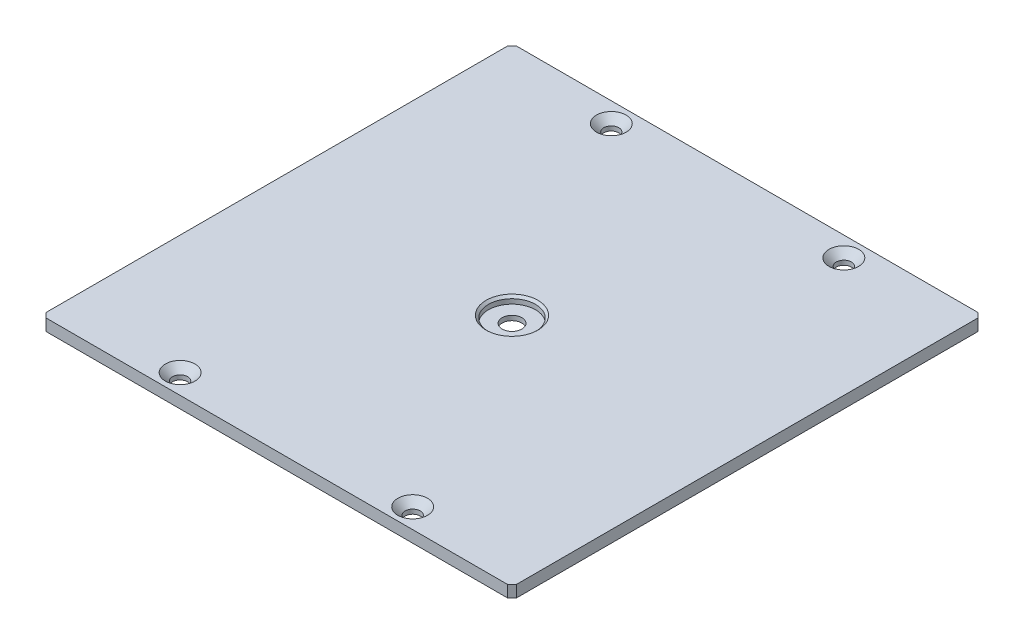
ISO-10303-21;
HEADER;
FILE_DESCRIPTION(('STEP AP214'),'2;1');
FILE_NAME('part.step','',(''),(''),'','','');
FILE_SCHEMA(('AUTOMOTIVE_DESIGN { 1 0 10303 214 1 1 1 1 }'));
ENDSEC;
DATA;
#1=APPLICATION_CONTEXT('core data for automotive mechanical design processes');
#2=APPLICATION_PROTOCOL_DEFINITION('international standard','automotive_design',2000,#1);
#3=PRODUCT_CONTEXT('',#1,'mechanical');
#4=PRODUCT('Part','Part','',(#3));
#5=PRODUCT_RELATED_PRODUCT_CATEGORY('part','',(#4));
#6=PRODUCT_DEFINITION_FORMATION('','',#4);
#7=PRODUCT_DEFINITION_CONTEXT('part definition',#1,'design');
#8=PRODUCT_DEFINITION('design','',#6,#7);
#9=PRODUCT_DEFINITION_SHAPE('','',#8);
#10=(LENGTH_UNIT() NAMED_UNIT(*) SI_UNIT(.MILLI.,.METRE.));
#11=(NAMED_UNIT(*) PLANE_ANGLE_UNIT() SI_UNIT($,.RADIAN.));
#12=(NAMED_UNIT(*) SI_UNIT($,.STERADIAN.) SOLID_ANGLE_UNIT());
#13=UNCERTAINTY_MEASURE_WITH_UNIT(LENGTH_MEASURE(1.E-05),#10,'distance_accuracy_value','');
#14=(GEOMETRIC_REPRESENTATION_CONTEXT(3) GLOBAL_UNCERTAINTY_ASSIGNED_CONTEXT((#13)) GLOBAL_UNIT_ASSIGNED_CONTEXT((#10,
#11,#12)) REPRESENTATION_CONTEXT('',''));
#15=CARTESIAN_POINT('',(0.,0.,0.));
#16=DIRECTION('',(0.,0.,1.));
#17=DIRECTION('',(1.,0.,0.));
#18=AXIS2_PLACEMENT_3D('',#15,#16,#17);
#19=CARTESIAN_POINT('',(0.,0.,0.));
#20=DIRECTION('',(0.,-1.,0.));
#21=DIRECTION('',(0.,0.,-1.));
#22=AXIS2_PLACEMENT_3D('',#19,#20,#21);
#23=PLANE('',#22);
#24=CARTESIAN_POINT('',(-24.7,0.,-45.8));
#25=DIRECTION('',(0.,-1.,0.));
#26=DIRECTION('',(0.,0.,-1.));
#27=AXIS2_PLACEMENT_3D('',#24,#25,#26);
#28=CIRCLE('',#27,1.6);
#29=CARTESIAN_POINT('',(-24.7,0.,-47.4));
#30=VERTEX_POINT('',#29);
#31=EDGE_CURVE('E384',#30,#30,#28,.T.);
#32=ORIENTED_EDGE('',*,*,#31,.F.);
#33=EDGE_LOOP('',(#32));
#34=FACE_BOUND('',#33,.T.);
#35=CARTESIAN_POINT('',(24.7,0.,-45.8));
#36=DIRECTION('',(0.,-1.,0.));
#37=DIRECTION('',(0.,0.,-1.));
#38=AXIS2_PLACEMENT_3D('',#35,#36,#37);
#39=CIRCLE('',#38,1.6);
#40=CARTESIAN_POINT('',(24.7,0.,-47.4));
#41=VERTEX_POINT('',#40);
#42=EDGE_CURVE('E379',#41,#41,#39,.T.);
#43=ORIENTED_EDGE('',*,*,#42,.F.);
#44=EDGE_LOOP('',(#43));
#45=FACE_BOUND('',#44,.T.);
#46=CARTESIAN_POINT('',(-24.7,0.,45.8));
#47=DIRECTION('',(0.,-1.,0.));
#48=DIRECTION('',(0.,0.,-1.));
#49=AXIS2_PLACEMENT_3D('',#46,#47,#48);
#50=CIRCLE('',#49,1.6);
#51=CARTESIAN_POINT('',(-24.7,0.,44.2));
#52=VERTEX_POINT('',#51);
#53=EDGE_CURVE('E374',#52,#52,#50,.T.);
#54=ORIENTED_EDGE('',*,*,#53,.F.);
#55=EDGE_LOOP('',(#54));
#56=FACE_BOUND('',#55,.T.);
#57=CARTESIAN_POINT('',(24.7,0.,45.8));
#58=DIRECTION('',(0.,-1.,0.));
#59=DIRECTION('',(0.,0.,-1.));
#60=AXIS2_PLACEMENT_3D('',#57,#58,#59);
#61=CIRCLE('',#60,1.6);
#62=CARTESIAN_POINT('',(24.7,0.,44.2));
#63=VERTEX_POINT('',#62);
#64=EDGE_CURVE('E370',#63,#63,#61,.T.);
#65=ORIENTED_EDGE('',*,*,#64,.F.);
#66=EDGE_LOOP('',(#65));
#67=FACE_BOUND('',#66,.T.);
#68=DIRECTION('',(-1.,0.,0.));
#69=VECTOR('',#68,1.);
#70=CARTESIAN_POINT('',(47.4,0.,17.));
#71=LINE('',#70,#69);
#72=CARTESIAN_POINT('',(47.4,0.,17.));
#73=VERTEX_POINT('',#72);
#74=CARTESIAN_POINT('',(45.4,0.,17.));
#75=VERTEX_POINT('',#74);
#76=EDGE_CURVE('E223',#73,#75,#71,.T.);
#77=ORIENTED_EDGE('',*,*,#76,.F.);
#78=DIRECTION('',(0.,0.,1.));
#79=VECTOR('',#78,1.);
#80=CARTESIAN_POINT('',(47.4,0.,-17.));
#81=LINE('',#80,#79);
#82=CARTESIAN_POINT('',(47.4,0.,-17.));
#83=VERTEX_POINT('',#82);
#84=EDGE_CURVE('E220',#83,#73,#81,.T.);
#85=ORIENTED_EDGE('',*,*,#84,.F.);
#86=DIRECTION('',(1.,0.,0.));
#87=VECTOR('',#86,1.);
#88=CARTESIAN_POINT('',(47.4,0.,-17.));
#89=LINE('',#88,#87);
#90=CARTESIAN_POINT('',(45.4,0.,-17.));
#91=VERTEX_POINT('',#90);
#92=EDGE_CURVE('E233',#91,#83,#89,.T.);
#93=ORIENTED_EDGE('',*,*,#92,.F.);
#94=DIRECTION('',(0.,0.,-1.));
#95=VECTOR('',#94,1.);
#96=CARTESIAN_POINT('',(45.4,0.,-17.));
#97=LINE('',#96,#95);
#98=EDGE_CURVE('E241',#75,#91,#97,.T.);
#99=ORIENTED_EDGE('',*,*,#98,.F.);
#100=EDGE_LOOP('',(#77,#85,#93,#99));
#101=FACE_BOUND('',#100,.T.);
#102=DIRECTION('',(1.,0.,0.));
#103=VECTOR('',#102,1.);
#104=CARTESIAN_POINT('',(-47.4,0.,-17.));
#105=LINE('',#104,#103);
#106=CARTESIAN_POINT('',(-47.4,0.,-17.));
#107=VERTEX_POINT('',#106);
#108=CARTESIAN_POINT('',(-45.4,0.,-17.));
#109=VERTEX_POINT('',#108);
#110=EDGE_CURVE('E298',#107,#109,#105,.T.);
#111=ORIENTED_EDGE('',*,*,#110,.F.);
#112=DIRECTION('',(0.,0.,-1.));
#113=VECTOR('',#112,1.);
#114=CARTESIAN_POINT('',(-47.4,0.,17.));
#115=LINE('',#114,#113);
#116=CARTESIAN_POINT('',(-47.4,0.,17.));
#117=VERTEX_POINT('',#116);
#118=EDGE_CURVE('E295',#117,#107,#115,.T.);
#119=ORIENTED_EDGE('',*,*,#118,.F.);
#120=DIRECTION('',(-1.,0.,0.));
#121=VECTOR('',#120,1.);
#122=CARTESIAN_POINT('',(-47.4,0.,17.));
#123=LINE('',#122,#121);
#124=CARTESIAN_POINT('',(-45.4,0.,17.));
#125=VERTEX_POINT('',#124);
#126=EDGE_CURVE('E288',#125,#117,#123,.T.);
#127=ORIENTED_EDGE('',*,*,#126,.F.);
#128=DIRECTION('',(0.,0.,1.));
#129=VECTOR('',#128,1.);
#130=CARTESIAN_POINT('',(-45.4,0.,17.));
#131=LINE('',#130,#129);
#132=EDGE_CURVE('E300',#109,#125,#131,.T.);
#133=ORIENTED_EDGE('',*,*,#132,.F.);
#134=EDGE_LOOP('',(#111,#119,#127,#133));
#135=FACE_BOUND('',#134,.T.);
#136=DIRECTION('',(1.,0.,0.));
#137=VECTOR('',#136,1.);
#138=CARTESIAN_POINT('',(50.,0.,50.));
#139=LINE('',#138,#137);
#140=CARTESIAN_POINT('',(-48.9999999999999,0.,50.));
#141=VERTEX_POINT('',#140);
#142=CARTESIAN_POINT('',(49.,0.,50.));
#143=VERTEX_POINT('',#142);
#144=EDGE_CURVE('E328',#141,#143,#139,.T.);
#145=ORIENTED_EDGE('',*,*,#144,.F.);
#146=DIRECTION('',(0.707106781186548,0.,0.707106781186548));
#147=VECTOR('',#146,1.);
#148=CARTESIAN_POINT('',(-49.5,0.,49.5));
#149=LINE('',#148,#147);
#150=CARTESIAN_POINT('',(-50.,0.,49.));
#151=VERTEX_POINT('',#150);
#152=EDGE_CURVE('E347',#141,#151,#149,.F.);
#153=ORIENTED_EDGE('',*,*,#152,.T.);
#154=DIRECTION('',(0.,0.,1.));
#155=VECTOR('',#154,1.);
#156=CARTESIAN_POINT('',(-50.,0.,-50.));
#157=LINE('',#156,#155);
#158=CARTESIAN_POINT('',(-50.,0.,-48.9999999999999));
#159=VERTEX_POINT('',#158);
#160=EDGE_CURVE('E313',#159,#151,#157,.T.);
#161=ORIENTED_EDGE('',*,*,#160,.F.);
#162=DIRECTION('',(-0.707106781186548,0.,0.707106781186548));
#163=VECTOR('',#162,1.);
#164=CARTESIAN_POINT('',(-49.5,0.,-49.5));
#165=LINE('',#164,#163);
#166=CARTESIAN_POINT('',(-49.,0.,-50.));
#167=VERTEX_POINT('',#166);
#168=EDGE_CURVE('E341',#159,#167,#165,.F.);
#169=ORIENTED_EDGE('',*,*,#168,.T.);
#170=DIRECTION('',(-1.,0.,0.));
#171=VECTOR('',#170,1.);
#172=CARTESIAN_POINT('',(50.,0.,-50.));
#173=LINE('',#172,#171);
#174=CARTESIAN_POINT('',(49.,0.,-50.));
#175=VERTEX_POINT('',#174);
#176=EDGE_CURVE('E318',#175,#167,#173,.T.);
#177=ORIENTED_EDGE('',*,*,#176,.F.);
#178=DIRECTION('',(-0.707106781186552,0.,-0.707106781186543));
#179=VECTOR('',#178,1.);
#180=CARTESIAN_POINT('',(49.4999999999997,0.,-49.5000000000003));
#181=LINE('',#180,#179);
#182=CARTESIAN_POINT('',(50.,0.,-49.));
#183=VERTEX_POINT('',#182);
#184=EDGE_CURVE('E343',#175,#183,#181,.F.);
#185=ORIENTED_EDGE('',*,*,#184,.T.);
#186=DIRECTION('',(0.,0.,-1.));
#187=VECTOR('',#186,1.);
#188=CARTESIAN_POINT('',(50.,0.,-50.));
#189=LINE('',#188,#187);
#190=CARTESIAN_POINT('',(50.,0.,49.));
#191=VERTEX_POINT('',#190);
#192=EDGE_CURVE('E331',#191,#183,#189,.T.);
#193=ORIENTED_EDGE('',*,*,#192,.F.);
#194=DIRECTION('',(0.707106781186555,0.,-0.70710678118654));
#195=VECTOR('',#194,1.);
#196=CARTESIAN_POINT('',(49.4999999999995,0.,49.5000000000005));
#197=LINE('',#196,#195);
#198=EDGE_CURVE('E345',#191,#143,#197,.F.);
#199=ORIENTED_EDGE('',*,*,#198,.T.);
#200=EDGE_LOOP('',(#145,#153,#161,#169,#177,#185,#193,#199));
#201=FACE_BOUND('',#200,.T.);
#202=CARTESIAN_POINT('',(0.,0.,0.));
#203=DIRECTION('',(0.,-1.,0.));
#204=DIRECTION('',(0.,0.,-1.));
#205=AXIS2_PLACEMENT_3D('',#202,#203,#204);
#206=CIRCLE('',#205,2.09999999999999);
#207=CARTESIAN_POINT('',(0.,0.,-2.09999999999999));
#208=VERTEX_POINT('',#207);
#209=EDGE_CURVE('E283',#208,#208,#206,.T.);
#210=ORIENTED_EDGE('',*,*,#209,.F.);
#211=EDGE_LOOP('',(#210));
#212=FACE_BOUND('',#211,.T.);
#213=DIRECTION('',(0.,0.,-1.));
#214=VECTOR('',#213,1.);
#215=CARTESIAN_POINT('',(-16.9999999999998,0.,47.4000000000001));
#216=LINE('',#215,#214);
#217=CARTESIAN_POINT('',(-16.9999999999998,0.,47.4000000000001));
#218=VERTEX_POINT('',#217);
#219=CARTESIAN_POINT('',(-16.9999999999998,0.,45.4000000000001));
#220=VERTEX_POINT('',#219);
#221=EDGE_CURVE('E268',#218,#220,#216,.T.);
#222=ORIENTED_EDGE('',*,*,#221,.F.);
#223=DIRECTION('',(-1.,0.,0.));
#224=VECTOR('',#223,1.);
#225=CARTESIAN_POINT('',(17.0000000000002,0.,47.3999999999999));
#226=LINE('',#225,#224);
#227=CARTESIAN_POINT('',(17.0000000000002,0.,47.3999999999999));
#228=VERTEX_POINT('',#227);
#229=EDGE_CURVE('E254',#228,#218,#226,.T.);
#230=ORIENTED_EDGE('',*,*,#229,.F.);
#231=DIRECTION('',(0.,0.,1.));
#232=VECTOR('',#231,1.);
#233=CARTESIAN_POINT('',(17.0000000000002,0.,47.3999999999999));
#234=LINE('',#233,#232);
#235=CARTESIAN_POINT('',(17.0000000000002,0.,45.3999999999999));
#236=VERTEX_POINT('',#235);
#237=EDGE_CURVE('E259',#236,#228,#234,.T.);
#238=ORIENTED_EDGE('',*,*,#237,.F.);
#239=DIRECTION('',(1.,0.,0.));
#240=VECTOR('',#239,1.);
#241=CARTESIAN_POINT('',(17.0000000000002,0.,45.3999999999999));
#242=LINE('',#241,#240);
#243=EDGE_CURVE('E270',#220,#236,#242,.T.);
#244=ORIENTED_EDGE('',*,*,#243,.F.);
#245=EDGE_LOOP('',(#222,#230,#238,#244));
#246=FACE_BOUND('',#245,.T.);
#247=DIRECTION('',(0.,0.,1.));
#248=VECTOR('',#247,1.);
#249=CARTESIAN_POINT('',(16.9999999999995,0.,-47.4000000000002));
#250=LINE('',#249,#248);
#251=CARTESIAN_POINT('',(16.9999999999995,0.,-47.4000000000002));
#252=VERTEX_POINT('',#251);
#253=CARTESIAN_POINT('',(16.9999999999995,0.,-45.4000000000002));
#254=VERTEX_POINT('',#253);
#255=EDGE_CURVE('E480',#252,#254,#250,.T.);
#256=ORIENTED_EDGE('',*,*,#255,.F.);
#257=DIRECTION('',(1.,0.,0.));
#258=VECTOR('',#257,1.);
#259=CARTESIAN_POINT('',(-17.0000000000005,0.,-47.3999999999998));
#260=LINE('',#259,#258);
#261=CARTESIAN_POINT('',(-17.0000000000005,0.,-47.3999999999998));
#262=VERTEX_POINT('',#261);
#263=EDGE_CURVE('E218',#262,#252,#260,.T.);
#264=ORIENTED_EDGE('',*,*,#263,.F.);
#265=DIRECTION('',(0.,0.,-1.));
#266=VECTOR('',#265,1.);
#267=CARTESIAN_POINT('',(-17.0000000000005,0.,-47.3999999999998));
#268=LINE('',#267,#266);
#269=CARTESIAN_POINT('',(-17.0000000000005,0.,-45.3999999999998));
#270=VERTEX_POINT('',#269);
#271=EDGE_CURVE('E214',#270,#262,#268,.T.);
#272=ORIENTED_EDGE('',*,*,#271,.F.);
#273=DIRECTION('',(-1.,0.,0.));
#274=VECTOR('',#273,1.);
#275=CARTESIAN_POINT('',(-17.0000000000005,0.,-45.3999999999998));
#276=LINE('',#275,#274);
#277=EDGE_CURVE('E483',#254,#270,#276,.T.);
#278=ORIENTED_EDGE('',*,*,#277,.F.);
#279=EDGE_LOOP('',(#256,#264,#272,#278));
#280=FACE_BOUND('',#279,.T.);
#281=ADVANCED_FACE('F32',(#34,#45,#56,#67,#101,#135,#201,#212,#246,#280),#23,.T.);
#282=CARTESIAN_POINT('',(-50.,2.5,-50.));
#283=DIRECTION('',(1.,0.,0.));
#284=DIRECTION('',(0.,0.,-1.));
#285=AXIS2_PLACEMENT_3D('',#282,#283,#284);
#286=PLANE('',#285);
#287=ORIENTED_EDGE('',*,*,#160,.T.);
#288=DIRECTION('',(0.,1.,0.));
#289=VECTOR('',#288,1.);
#290=CARTESIAN_POINT('',(-50.,2.5,49.));
#291=LINE('',#290,#289);
#292=CARTESIAN_POINT('',(-50.,2.5,49.));
#293=VERTEX_POINT('',#292);
#294=EDGE_CURVE('E352',#151,#293,#291,.T.);
#295=ORIENTED_EDGE('',*,*,#294,.T.);
#296=DIRECTION('',(0.,0.,1.));
#297=VECTOR('',#296,1.);
#298=CARTESIAN_POINT('',(-50.,2.5,-50.));
#299=LINE('',#298,#297);
#300=CARTESIAN_POINT('',(-50.,2.5,-49.));
#301=VERTEX_POINT('',#300);
#302=EDGE_CURVE('E314',#301,#293,#299,.T.);
#303=ORIENTED_EDGE('',*,*,#302,.F.);
#304=DIRECTION('',(0.,-1.,0.));
#305=VECTOR('',#304,1.);
#306=CARTESIAN_POINT('',(-50.,2.5,-49.));
#307=LINE('',#306,#305);
#308=EDGE_CURVE('E349',#301,#159,#307,.T.);
#309=ORIENTED_EDGE('',*,*,#308,.T.);
#310=EDGE_LOOP('',(#287,#295,#303,#309));
#311=FACE_BOUND('',#310,.T.);
#312=ADVANCED_FACE('F408',(#311),#286,.F.);
#313=CARTESIAN_POINT('',(50.,2.5,50.));
#314=DIRECTION('',(0.,0.,-1.));
#315=DIRECTION('',(-1.,0.,0.));
#316=AXIS2_PLACEMENT_3D('',#313,#314,#315);
#317=PLANE('',#316);
#318=DIRECTION('',(1.,0.,0.));
#319=VECTOR('',#318,1.);
#320=CARTESIAN_POINT('',(50.,2.5,50.));
#321=LINE('',#320,#319);
#322=CARTESIAN_POINT('',(-48.9999999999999,2.5,50.));
#323=VERTEX_POINT('',#322);
#324=CARTESIAN_POINT('',(49.,2.5,50.));
#325=VERTEX_POINT('',#324);
#326=EDGE_CURVE('E317',#323,#325,#321,.T.);
#327=ORIENTED_EDGE('',*,*,#326,.F.);
#328=DIRECTION('',(0.,-1.,0.));
#329=VECTOR('',#328,1.);
#330=CARTESIAN_POINT('',(-49.,2.5,50.));
#331=LINE('',#330,#329);
#332=EDGE_CURVE('E338',#323,#141,#331,.T.);
#333=ORIENTED_EDGE('',*,*,#332,.T.);
#334=ORIENTED_EDGE('',*,*,#144,.T.);
#335=DIRECTION('',(0.,1.,0.));
#336=VECTOR('',#335,1.);
#337=CARTESIAN_POINT('',(49.,2.5,50.));
#338=LINE('',#337,#336);
#339=EDGE_CURVE('E325',#143,#325,#338,.T.);
#340=ORIENTED_EDGE('',*,*,#339,.T.);
#341=EDGE_LOOP('',(#327,#333,#334,#340));
#342=FACE_BOUND('',#341,.T.);
#343=ADVANCED_FACE('F414',(#342),#317,.F.);
#344=CARTESIAN_POINT('',(50.,2.5,-50.));
#345=DIRECTION('',(-1.,0.,0.));
#346=DIRECTION('',(0.,0.,1.));
#347=AXIS2_PLACEMENT_3D('',#344,#345,#346);
#348=PLANE('',#347);
#349=DIRECTION('',(0.,0.,-1.));
#350=VECTOR('',#349,1.);
#351=CARTESIAN_POINT('',(50.,2.5,-50.));
#352=LINE('',#351,#350);
#353=CARTESIAN_POINT('',(50.,2.5,49.));
#354=VERTEX_POINT('',#353);
#355=CARTESIAN_POINT('',(50.,2.5,-49.));
#356=VERTEX_POINT('',#355);
#357=EDGE_CURVE('E321',#354,#356,#352,.T.);
#358=ORIENTED_EDGE('',*,*,#357,.F.);
#359=DIRECTION('',(0.,-1.,0.));
#360=VECTOR('',#359,1.);
#361=CARTESIAN_POINT('',(50.,2.5,49.));
#362=LINE('',#361,#360);
#363=EDGE_CURVE('E363',#354,#191,#362,.T.);
#364=ORIENTED_EDGE('',*,*,#363,.T.);
#365=ORIENTED_EDGE('',*,*,#192,.T.);
#366=DIRECTION('',(0.,1.,0.));
#367=VECTOR('',#366,1.);
#368=CARTESIAN_POINT('',(50.,2.5,-49.));
#369=LINE('',#368,#367);
#370=EDGE_CURVE('E361',#183,#356,#369,.T.);
#371=ORIENTED_EDGE('',*,*,#370,.T.);
#372=EDGE_LOOP('',(#358,#364,#365,#371));
#373=FACE_BOUND('',#372,.T.);
#374=ADVANCED_FACE('F426',(#373),#348,.F.);
#375=CARTESIAN_POINT('',(50.,2.5,-50.));
#376=DIRECTION('',(0.,0.,1.));
#377=DIRECTION('',(1.,0.,0.));
#378=AXIS2_PLACEMENT_3D('',#375,#376,#377);
#379=PLANE('',#378);
#380=DIRECTION('',(-1.,0.,0.));
#381=VECTOR('',#380,1.);
#382=CARTESIAN_POINT('',(50.,2.5,-50.));
#383=LINE('',#382,#381);
#384=CARTESIAN_POINT('',(49.,2.5,-50.));
#385=VERTEX_POINT('',#384);
#386=CARTESIAN_POINT('',(-48.9999999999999,2.5,-50.));
#387=VERTEX_POINT('',#386);
#388=EDGE_CURVE('E323',#385,#387,#383,.T.);
#389=ORIENTED_EDGE('',*,*,#388,.F.);
#390=DIRECTION('',(0.,-1.,0.));
#391=VECTOR('',#390,1.);
#392=CARTESIAN_POINT('',(49.,2.5,-50.));
#393=LINE('',#392,#391);
#394=EDGE_CURVE('E367',#385,#175,#393,.T.);
#395=ORIENTED_EDGE('',*,*,#394,.T.);
#396=ORIENTED_EDGE('',*,*,#176,.T.);
#397=DIRECTION('',(0.,1.,0.));
#398=VECTOR('',#397,1.);
#399=CARTESIAN_POINT('',(-49.,2.5,-50.));
#400=LINE('',#399,#398);
#401=EDGE_CURVE('E47',#167,#387,#400,.T.);
#402=ORIENTED_EDGE('',*,*,#401,.T.);
#403=EDGE_LOOP('',(#389,#395,#396,#402));
#404=FACE_BOUND('',#403,.T.);
#405=ADVANCED_FACE('F423',(#404),#379,.F.);
#406=CARTESIAN_POINT('',(0.,2.5,0.));
#407=DIRECTION('',(0.,-1.,0.));
#408=DIRECTION('',(0.,0.,-1.));
#409=AXIS2_PLACEMENT_3D('',#406,#407,#408);
#410=PLANE('',#409);
#411=CARTESIAN_POINT('',(0.,2.5,0.));
#412=DIRECTION('',(0.,-1.,0.));
#413=DIRECTION('',(0.,0.,-1.));
#414=AXIS2_PLACEMENT_3D('',#411,#412,#413);
#415=CIRCLE('',#414,5.50000000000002);
#416=CARTESIAN_POINT('',(0.,2.5,-5.50000000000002));
#417=VERTEX_POINT('',#416);
#418=EDGE_CURVE('E11',#417,#417,#415,.T.);
#419=ORIENTED_EDGE('',*,*,#418,.T.);
#420=EDGE_LOOP('',(#419));
#421=FACE_BOUND('',#420,.T.);
#422=CARTESIAN_POINT('',(-24.7,2.5,-45.8));
#423=DIRECTION('',(0.,1.,0.));
#424=DIRECTION('',(0.,0.,1.));
#425=AXIS2_PLACEMENT_3D('',#422,#423,#424);
#426=CIRCLE('',#425,3.15);
#427=CARTESIAN_POINT('',(-24.7,2.5,-42.65));
#428=VERTEX_POINT('',#427);
#429=EDGE_CURVE('E391',#428,#428,#426,.T.);
#430=ORIENTED_EDGE('',*,*,#429,.F.);
#431=EDGE_LOOP('',(#430));
#432=FACE_BOUND('',#431,.T.);
#433=CARTESIAN_POINT('',(24.7,2.5,-45.8));
#434=DIRECTION('',(0.,1.,0.));
#435=DIRECTION('',(0.,0.,1.));
#436=AXIS2_PLACEMENT_3D('',#433,#434,#435);
#437=CIRCLE('',#436,3.15);
#438=CARTESIAN_POINT('',(24.7,2.5,-42.65));
#439=VERTEX_POINT('',#438);
#440=EDGE_CURVE('E387',#439,#439,#437,.T.);
#441=ORIENTED_EDGE('',*,*,#440,.F.);
#442=EDGE_LOOP('',(#441));
#443=FACE_BOUND('',#442,.T.);
#444=CARTESIAN_POINT('',(-24.7,2.5,45.8));
#445=DIRECTION('',(0.,1.,0.));
#446=DIRECTION('',(0.,0.,1.));
#447=AXIS2_PLACEMENT_3D('',#444,#445,#446);
#448=CIRCLE('',#447,3.15);
#449=CARTESIAN_POINT('',(-24.7,2.5,48.95));
#450=VERTEX_POINT('',#449);
#451=EDGE_CURVE('E382',#450,#450,#448,.T.);
#452=ORIENTED_EDGE('',*,*,#451,.F.);
#453=EDGE_LOOP('',(#452));
#454=FACE_BOUND('',#453,.T.);
#455=CARTESIAN_POINT('',(24.7,2.5,45.8));
#456=DIRECTION('',(0.,1.,0.));
#457=DIRECTION('',(0.,0.,1.));
#458=AXIS2_PLACEMENT_3D('',#455,#456,#457);
#459=CIRCLE('',#458,3.15);
#460=CARTESIAN_POINT('',(24.7,2.5,48.95));
#461=VERTEX_POINT('',#460);
#462=EDGE_CURVE('E377',#461,#461,#459,.T.);
#463=ORIENTED_EDGE('',*,*,#462,.F.);
#464=EDGE_LOOP('',(#463));
#465=FACE_BOUND('',#464,.T.);
#466=ORIENTED_EDGE('',*,*,#302,.T.);
#467=DIRECTION('',(-0.707106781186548,0.,-0.707106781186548));
#468=VECTOR('',#467,1.);
#469=CARTESIAN_POINT('',(-49.,2.5,50.));
#470=LINE('',#469,#468);
#471=EDGE_CURVE('E359',#293,#323,#470,.F.);
#472=ORIENTED_EDGE('',*,*,#471,.T.);
#473=ORIENTED_EDGE('',*,*,#326,.T.);
#474=DIRECTION('',(-0.707106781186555,0.,0.70710678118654));
#475=VECTOR('',#474,1.);
#476=CARTESIAN_POINT('',(50.,2.5,49.));
#477=LINE('',#476,#475);
#478=EDGE_CURVE('E357',#325,#354,#477,.F.);
#479=ORIENTED_EDGE('',*,*,#478,.T.);
#480=ORIENTED_EDGE('',*,*,#357,.T.);
#481=DIRECTION('',(0.707106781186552,0.,0.707106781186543));
#482=VECTOR('',#481,1.);
#483=CARTESIAN_POINT('',(49.,2.5,-50.));
#484=LINE('',#483,#482);
#485=EDGE_CURVE('E54',#356,#385,#484,.F.);
#486=ORIENTED_EDGE('',*,*,#485,.T.);
#487=ORIENTED_EDGE('',*,*,#388,.T.);
#488=DIRECTION('',(0.707106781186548,0.,-0.707106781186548));
#489=VECTOR('',#488,1.);
#490=CARTESIAN_POINT('',(-50.,2.5,-49.));
#491=LINE('',#490,#489);
#492=EDGE_CURVE('E354',#387,#301,#491,.F.);
#493=ORIENTED_EDGE('',*,*,#492,.T.);
#494=EDGE_LOOP('',(#466,#472,#473,#479,#480,#486,#487,#493));
#495=FACE_BOUND('',#494,.T.);
#496=ADVANCED_FACE('F421',(#421,#432,#443,#454,#465,#495),#410,.F.);
#497=CARTESIAN_POINT('',(-47.4,-2.,17.));
#498=DIRECTION('',(1.,0.,0.));
#499=DIRECTION('',(0.,0.,-1.));
#500=AXIS2_PLACEMENT_3D('',#497,#498,#499);
#501=PLANE('',#500);
#502=ORIENTED_EDGE('',*,*,#118,.T.);
#503=DIRECTION('',(0.,1.,0.));
#504=VECTOR('',#503,1.);
#505=CARTESIAN_POINT('',(-47.4,-2.,-17.));
#506=LINE('',#505,#504);
#507=CARTESIAN_POINT('',(-47.4,-2.,-17.));
#508=VERTEX_POINT('',#507);
#509=EDGE_CURVE('E311',#508,#107,#506,.T.);
#510=ORIENTED_EDGE('',*,*,#509,.F.);
#511=DIRECTION('',(0.,0.,-1.));
#512=VECTOR('',#511,1.);
#513=CARTESIAN_POINT('',(-47.4,-2.,17.));
#514=LINE('',#513,#512);
#515=CARTESIAN_POINT('',(-47.4,-2.,17.));
#516=VERTEX_POINT('',#515);
#517=EDGE_CURVE('E284',#516,#508,#514,.T.);
#518=ORIENTED_EDGE('',*,*,#517,.F.);
#519=DIRECTION('',(0.,1.,0.));
#520=VECTOR('',#519,1.);
#521=CARTESIAN_POINT('',(-47.4,-2.,17.));
#522=LINE('',#521,#520);
#523=EDGE_CURVE('E294',#516,#117,#522,.T.);
#524=ORIENTED_EDGE('',*,*,#523,.T.);
#525=EDGE_LOOP('',(#502,#510,#518,#524));
#526=FACE_BOUND('',#525,.T.);
#527=ADVANCED_FACE('F550',(#526),#501,.F.);
#528=CARTESIAN_POINT('',(-47.4,-2.,-17.));
#529=DIRECTION('',(0.,0.,1.));
#530=DIRECTION('',(1.,0.,0.));
#531=AXIS2_PLACEMENT_3D('',#528,#529,#530);
#532=PLANE('',#531);
#533=ORIENTED_EDGE('',*,*,#110,.T.);
#534=DIRECTION('',(0.,1.,0.));
#535=VECTOR('',#534,1.);
#536=CARTESIAN_POINT('',(-45.4,-2.,-17.));
#537=LINE('',#536,#535);
#538=CARTESIAN_POINT('',(-45.4,-2.,-17.));
#539=VERTEX_POINT('',#538);
#540=EDGE_CURVE('E308',#539,#109,#537,.T.);
#541=ORIENTED_EDGE('',*,*,#540,.F.);
#542=DIRECTION('',(1.,0.,0.));
#543=VECTOR('',#542,1.);
#544=CARTESIAN_POINT('',(-47.4,-2.,-17.));
#545=LINE('',#544,#543);
#546=EDGE_CURVE('E287',#508,#539,#545,.T.);
#547=ORIENTED_EDGE('',*,*,#546,.F.);
#548=ORIENTED_EDGE('',*,*,#509,.T.);
#549=EDGE_LOOP('',(#533,#541,#547,#548));
#550=FACE_BOUND('',#549,.T.);
#551=ADVANCED_FACE('F547',(#550),#532,.F.);
#552=CARTESIAN_POINT('',(-45.4,-2.,17.));
#553=DIRECTION('',(-1.,0.,0.));
#554=DIRECTION('',(0.,0.,1.));
#555=AXIS2_PLACEMENT_3D('',#552,#553,#554);
#556=PLANE('',#555);
#557=ORIENTED_EDGE('',*,*,#132,.T.);
#558=DIRECTION('',(0.,1.,0.));
#559=VECTOR('',#558,1.);
#560=CARTESIAN_POINT('',(-45.4,-2.,17.));
#561=LINE('',#560,#559);
#562=CARTESIAN_POINT('',(-45.4,-2.,17.));
#563=VERTEX_POINT('',#562);
#564=EDGE_CURVE('E306',#563,#125,#561,.T.);
#565=ORIENTED_EDGE('',*,*,#564,.F.);
#566=DIRECTION('',(0.,0.,1.));
#567=VECTOR('',#566,1.);
#568=CARTESIAN_POINT('',(-45.4,-2.,17.));
#569=LINE('',#568,#567);
#570=EDGE_CURVE('E290',#539,#563,#569,.T.);
#571=ORIENTED_EDGE('',*,*,#570,.F.);
#572=ORIENTED_EDGE('',*,*,#540,.T.);
#573=EDGE_LOOP('',(#557,#565,#571,#572));
#574=FACE_BOUND('',#573,.T.);
#575=ADVANCED_FACE('F543',(#574),#556,.F.);
#576=CARTESIAN_POINT('',(-47.4,-2.,17.));
#577=DIRECTION('',(0.,0.,-1.));
#578=DIRECTION('',(-1.,0.,0.));
#579=AXIS2_PLACEMENT_3D('',#576,#577,#578);
#580=PLANE('',#579);
#581=ORIENTED_EDGE('',*,*,#126,.T.);
#582=ORIENTED_EDGE('',*,*,#523,.F.);
#583=DIRECTION('',(-1.,0.,0.));
#584=VECTOR('',#583,1.);
#585=CARTESIAN_POINT('',(-47.4,-2.,17.));
#586=LINE('',#585,#584);
#587=EDGE_CURVE('E292',#563,#516,#586,.T.);
#588=ORIENTED_EDGE('',*,*,#587,.F.);
#589=ORIENTED_EDGE('',*,*,#564,.T.);
#590=EDGE_LOOP('',(#581,#582,#588,#589));
#591=FACE_BOUND('',#590,.T.);
#592=ADVANCED_FACE('F536',(#591),#580,.F.);
#593=CARTESIAN_POINT('',(0.,-2.,0.));
#594=DIRECTION('',(0.,-1.,0.));
#595=DIRECTION('',(0.,0.,-1.));
#596=AXIS2_PLACEMENT_3D('',#593,#594,#595);
#597=PLANE('',#596);
#598=ORIENTED_EDGE('',*,*,#517,.T.);
#599=ORIENTED_EDGE('',*,*,#546,.T.);
#600=ORIENTED_EDGE('',*,*,#570,.T.);
#601=ORIENTED_EDGE('',*,*,#587,.T.);
#602=EDGE_LOOP('',(#598,#599,#600,#601));
#603=FACE_BOUND('',#602,.T.);
#604=ADVANCED_FACE('F527',(#603),#597,.T.);
#605=CARTESIAN_POINT('',(0.,2.5,0.));
#606=DIRECTION('',(0.,1.,0.));
#607=DIRECTION('',(0.,0.,1.));
#608=AXIS2_PLACEMENT_3D('',#605,#606,#607);
#609=CYLINDRICAL_SURFACE('',#608,2.09999999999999);
#610=CARTESIAN_POINT('',(0.,1.,0.));
#611=DIRECTION('',(0.,-1.,0.));
#612=DIRECTION('',(0.,0.,-1.));
#613=AXIS2_PLACEMENT_3D('',#610,#611,#612);
#614=CIRCLE('',#613,2.09999999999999);
#615=CARTESIAN_POINT('',(0.,1.,-2.09999999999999));
#616=VERTEX_POINT('',#615);
#617=EDGE_CURVE('E389',#616,#616,#614,.F.);
#618=ORIENTED_EDGE('',*,*,#617,.T.);
#619=EDGE_LOOP('',(#618));
#620=FACE_BOUND('',#619,.T.);
#621=ORIENTED_EDGE('',*,*,#209,.T.);
#622=EDGE_LOOP('',(#621));
#623=FACE_BOUND('',#622,.T.);
#624=ADVANCED_FACE('F523',(#620,#623),#609,.F.);
#625=CARTESIAN_POINT('',(17.0000000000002,-2.,47.3999999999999));
#626=DIRECTION('',(0.,0.,-1.));
#627=DIRECTION('',(-1.,0.,0.));
#628=AXIS2_PLACEMENT_3D('',#625,#626,#627);
#629=PLANE('',#628);
#630=ORIENTED_EDGE('',*,*,#229,.T.);
#631=DIRECTION('',(0.,1.,0.));
#632=VECTOR('',#631,1.);
#633=CARTESIAN_POINT('',(-16.9999999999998,-2.,47.4000000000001));
#634=LINE('',#633,#632);
#635=CARTESIAN_POINT('',(-16.9999999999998,-2.,47.4000000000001));
#636=VERTEX_POINT('',#635);
#637=EDGE_CURVE('E281',#636,#218,#634,.T.);
#638=ORIENTED_EDGE('',*,*,#637,.F.);
#639=DIRECTION('',(-1.,0.,0.));
#640=VECTOR('',#639,1.);
#641=CARTESIAN_POINT('',(17.0000000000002,-2.,47.3999999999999));
#642=LINE('',#641,#640);
#643=CARTESIAN_POINT('',(17.0000000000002,-2.,47.3999999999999));
#644=VERTEX_POINT('',#643);
#645=EDGE_CURVE('E255',#644,#636,#642,.T.);
#646=ORIENTED_EDGE('',*,*,#645,.F.);
#647=DIRECTION('',(0.,1.,0.));
#648=VECTOR('',#647,1.);
#649=CARTESIAN_POINT('',(17.0000000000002,-2.,47.3999999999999));
#650=LINE('',#649,#648);
#651=EDGE_CURVE('E265',#644,#228,#650,.T.);
#652=ORIENTED_EDGE('',*,*,#651,.T.);
#653=EDGE_LOOP('',(#630,#638,#646,#652));
#654=FACE_BOUND('',#653,.T.);
#655=ADVANCED_FACE('F526',(#654),#629,.F.);
#656=CARTESIAN_POINT('',(-16.9999999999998,-2.,47.4000000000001));
#657=DIRECTION('',(1.,0.,0.));
#658=DIRECTION('',(0.,0.,-1.));
#659=AXIS2_PLACEMENT_3D('',#656,#657,#658);
#660=PLANE('',#659);
#661=ORIENTED_EDGE('',*,*,#221,.T.);
#662=DIRECTION('',(0.,1.,0.));
#663=VECTOR('',#662,1.);
#664=CARTESIAN_POINT('',(-16.9999999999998,-2.,45.4000000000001));
#665=LINE('',#664,#663);
#666=CARTESIAN_POINT('',(-16.9999999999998,-2.,45.4000000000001));
#667=VERTEX_POINT('',#666);
#668=EDGE_CURVE('E278',#667,#220,#665,.T.);
#669=ORIENTED_EDGE('',*,*,#668,.F.);
#670=DIRECTION('',(0.,0.,-1.));
#671=VECTOR('',#670,1.);
#672=CARTESIAN_POINT('',(-16.9999999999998,-2.,47.4000000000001));
#673=LINE('',#672,#671);
#674=EDGE_CURVE('E258',#636,#667,#673,.T.);
#675=ORIENTED_EDGE('',*,*,#674,.F.);
#676=ORIENTED_EDGE('',*,*,#637,.T.);
#677=EDGE_LOOP('',(#661,#669,#675,#676));
#678=FACE_BOUND('',#677,.T.);
#679=ADVANCED_FACE('F533',(#678),#660,.F.);
#680=CARTESIAN_POINT('',(17.0000000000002,-2.,45.3999999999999));
#681=DIRECTION('',(0.,0.,1.));
#682=DIRECTION('',(1.,0.,0.));
#683=AXIS2_PLACEMENT_3D('',#680,#681,#682);
#684=PLANE('',#683);
#685=ORIENTED_EDGE('',*,*,#243,.T.);
#686=DIRECTION('',(0.,1.,0.));
#687=VECTOR('',#686,1.);
#688=CARTESIAN_POINT('',(17.0000000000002,-2.,45.3999999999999));
#689=LINE('',#688,#687);
#690=CARTESIAN_POINT('',(17.0000000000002,-2.,45.3999999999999));
#691=VERTEX_POINT('',#690);
#692=EDGE_CURVE('E276',#691,#236,#689,.T.);
#693=ORIENTED_EDGE('',*,*,#692,.F.);
#694=DIRECTION('',(1.,0.,0.));
#695=VECTOR('',#694,1.);
#696=CARTESIAN_POINT('',(17.0000000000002,-2.,45.3999999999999));
#697=LINE('',#696,#695);
#698=EDGE_CURVE('E261',#667,#691,#697,.T.);
#699=ORIENTED_EDGE('',*,*,#698,.F.);
#700=ORIENTED_EDGE('',*,*,#668,.T.);
#701=EDGE_LOOP('',(#685,#693,#699,#700));
#702=FACE_BOUND('',#701,.T.);
#703=ADVANCED_FACE('F631',(#702),#684,.F.);
#704=CARTESIAN_POINT('',(17.0000000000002,-2.,47.3999999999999));
#705=DIRECTION('',(-1.,0.,0.));
#706=DIRECTION('',(0.,0.,1.));
#707=AXIS2_PLACEMENT_3D('',#704,#705,#706);
#708=PLANE('',#707);
#709=ORIENTED_EDGE('',*,*,#237,.T.);
#710=ORIENTED_EDGE('',*,*,#651,.F.);
#711=DIRECTION('',(0.,0.,1.));
#712=VECTOR('',#711,1.);
#713=CARTESIAN_POINT('',(17.0000000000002,-2.,47.3999999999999));
#714=LINE('',#713,#712);
#715=EDGE_CURVE('E263',#691,#644,#714,.T.);
#716=ORIENTED_EDGE('',*,*,#715,.F.);
#717=ORIENTED_EDGE('',*,*,#692,.T.);
#718=EDGE_LOOP('',(#709,#710,#716,#717));
#719=FACE_BOUND('',#718,.T.);
#720=ADVANCED_FACE('F627',(#719),#708,.F.);
#721=CARTESIAN_POINT('',(0.,-2.,0.));
#722=DIRECTION('',(0.,-1.,0.));
#723=DIRECTION('',(-1.,0.,0.));
#724=AXIS2_PLACEMENT_3D('',#721,#722,#723);
#725=PLANE('',#724);
#726=ORIENTED_EDGE('',*,*,#645,.T.);
#727=ORIENTED_EDGE('',*,*,#674,.T.);
#728=ORIENTED_EDGE('',*,*,#698,.T.);
#729=ORIENTED_EDGE('',*,*,#715,.T.);
#730=EDGE_LOOP('',(#726,#727,#728,#729));
#731=FACE_BOUND('',#730,.T.);
#732=ADVANCED_FACE('F623',(#731),#725,.T.);
#733=CARTESIAN_POINT('',(47.4,-2.,-17.));
#734=DIRECTION('',(-1.,0.,0.));
#735=DIRECTION('',(0.,0.,1.));
#736=AXIS2_PLACEMENT_3D('',#733,#734,#735);
#737=PLANE('',#736);
#738=ORIENTED_EDGE('',*,*,#84,.T.);
#739=DIRECTION('',(0.,1.,0.));
#740=VECTOR('',#739,1.);
#741=CARTESIAN_POINT('',(47.4,-2.,17.));
#742=LINE('',#741,#740);
#743=CARTESIAN_POINT('',(47.4,-2.,17.));
#744=VERTEX_POINT('',#743);
#745=EDGE_CURVE('E252',#744,#73,#742,.T.);
#746=ORIENTED_EDGE('',*,*,#745,.F.);
#747=DIRECTION('',(0.,0.,1.));
#748=VECTOR('',#747,1.);
#749=CARTESIAN_POINT('',(47.4,-2.,-17.));
#750=LINE('',#749,#748);
#751=CARTESIAN_POINT('',(47.4,-2.,-17.));
#752=VERTEX_POINT('',#751);
#753=EDGE_CURVE('E229',#752,#744,#750,.T.);
#754=ORIENTED_EDGE('',*,*,#753,.F.);
#755=DIRECTION('',(0.,1.,0.));
#756=VECTOR('',#755,1.);
#757=CARTESIAN_POINT('',(47.4,-2.,-17.));
#758=LINE('',#757,#756);
#759=EDGE_CURVE('E238',#752,#83,#758,.T.);
#760=ORIENTED_EDGE('',*,*,#759,.T.);
#761=EDGE_LOOP('',(#738,#746,#754,#760));
#762=FACE_BOUND('',#761,.T.);
#763=ADVANCED_FACE('F619',(#762),#737,.F.);
#764=CARTESIAN_POINT('',(47.4,-2.,17.));
#765=DIRECTION('',(0.,0.,-1.));
#766=DIRECTION('',(-1.,0.,0.));
#767=AXIS2_PLACEMENT_3D('',#764,#765,#766);
#768=PLANE('',#767);
#769=ORIENTED_EDGE('',*,*,#76,.T.);
#770=DIRECTION('',(0.,1.,0.));
#771=VECTOR('',#770,1.);
#772=CARTESIAN_POINT('',(45.4,-2.,17.));
#773=LINE('',#772,#771);
#774=CARTESIAN_POINT('',(45.4,-2.,17.));
#775=VERTEX_POINT('',#774);
#776=EDGE_CURVE('E249',#775,#75,#773,.T.);
#777=ORIENTED_EDGE('',*,*,#776,.F.);
#778=DIRECTION('',(-1.,0.,0.));
#779=VECTOR('',#778,1.);
#780=CARTESIAN_POINT('',(47.4,-2.,17.));
#781=LINE('',#780,#779);
#782=EDGE_CURVE('E232',#744,#775,#781,.T.);
#783=ORIENTED_EDGE('',*,*,#782,.F.);
#784=ORIENTED_EDGE('',*,*,#745,.T.);
#785=EDGE_LOOP('',(#769,#777,#783,#784));
#786=FACE_BOUND('',#785,.T.);
#787=ADVANCED_FACE('F615',(#786),#768,.F.);
#788=CARTESIAN_POINT('',(45.4,-2.,-17.));
#789=DIRECTION('',(1.,0.,0.));
#790=DIRECTION('',(0.,0.,-1.));
#791=AXIS2_PLACEMENT_3D('',#788,#789,#790);
#792=PLANE('',#791);
#793=ORIENTED_EDGE('',*,*,#98,.T.);
#794=DIRECTION('',(0.,1.,0.));
#795=VECTOR('',#794,1.);
#796=CARTESIAN_POINT('',(45.4,-2.,-17.));
#797=LINE('',#796,#795);
#798=CARTESIAN_POINT('',(45.4,-2.,-17.));
#799=VERTEX_POINT('',#798);
#800=EDGE_CURVE('E247',#799,#91,#797,.T.);
#801=ORIENTED_EDGE('',*,*,#800,.F.);
#802=DIRECTION('',(0.,0.,-1.));
#803=VECTOR('',#802,1.);
#804=CARTESIAN_POINT('',(45.4,-2.,-17.));
#805=LINE('',#804,#803);
#806=EDGE_CURVE('E235',#775,#799,#805,.T.);
#807=ORIENTED_EDGE('',*,*,#806,.F.);
#808=ORIENTED_EDGE('',*,*,#776,.T.);
#809=EDGE_LOOP('',(#793,#801,#807,#808));
#810=FACE_BOUND('',#809,.T.);
#811=ADVANCED_FACE('F611',(#810),#792,.F.);
#812=CARTESIAN_POINT('',(47.4,-2.,-17.));
#813=DIRECTION('',(0.,0.,1.));
#814=DIRECTION('',(1.,0.,0.));
#815=AXIS2_PLACEMENT_3D('',#812,#813,#814);
#816=PLANE('',#815);
#817=ORIENTED_EDGE('',*,*,#92,.T.);
#818=ORIENTED_EDGE('',*,*,#759,.F.);
#819=DIRECTION('',(1.,0.,0.));
#820=VECTOR('',#819,1.);
#821=CARTESIAN_POINT('',(47.4,-2.,-17.));
#822=LINE('',#821,#820);
#823=EDGE_CURVE('E237',#799,#752,#822,.T.);
#824=ORIENTED_EDGE('',*,*,#823,.F.);
#825=ORIENTED_EDGE('',*,*,#800,.T.);
#826=EDGE_LOOP('',(#817,#818,#824,#825));
#827=FACE_BOUND('',#826,.T.);
#828=ADVANCED_FACE('F607',(#827),#816,.F.);
#829=CARTESIAN_POINT('',(0.,-2.,0.));
#830=DIRECTION('',(0.,-1.,0.));
#831=DIRECTION('',(0.,0.,1.));
#832=AXIS2_PLACEMENT_3D('',#829,#830,#831);
#833=PLANE('',#832);
#834=ORIENTED_EDGE('',*,*,#753,.T.);
#835=ORIENTED_EDGE('',*,*,#782,.T.);
#836=ORIENTED_EDGE('',*,*,#806,.T.);
#837=ORIENTED_EDGE('',*,*,#823,.T.);
#838=EDGE_LOOP('',(#834,#835,#836,#837));
#839=FACE_BOUND('',#838,.T.);
#840=ADVANCED_FACE('F604',(#839),#833,.T.);
#841=CARTESIAN_POINT('',(-17.0000000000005,-2.,-47.3999999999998));
#842=DIRECTION('',(0.,0.,1.));
#843=DIRECTION('',(1.,0.,0.));
#844=AXIS2_PLACEMENT_3D('',#841,#842,#843);
#845=PLANE('',#844);
#846=ORIENTED_EDGE('',*,*,#263,.T.);
#847=DIRECTION('',(0.,1.,0.));
#848=VECTOR('',#847,1.);
#849=CARTESIAN_POINT('',(16.9999999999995,-2.,-47.4000000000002));
#850=LINE('',#849,#848);
#851=CARTESIAN_POINT('',(16.9999999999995,-2.,-47.4000000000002));
#852=VERTEX_POINT('',#851);
#853=EDGE_CURVE('E198',#852,#252,#850,.T.);
#854=ORIENTED_EDGE('',*,*,#853,.F.);
#855=DIRECTION('',(1.,0.,0.));
#856=VECTOR('',#855,1.);
#857=CARTESIAN_POINT('',(-17.0000000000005,-2.,-47.3999999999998));
#858=LINE('',#857,#856);
#859=CARTESIAN_POINT('',(-17.0000000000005,-2.,-47.3999999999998));
#860=VERTEX_POINT('',#859);
#861=EDGE_CURVE('E205',#860,#852,#858,.T.);
#862=ORIENTED_EDGE('',*,*,#861,.F.);
#863=DIRECTION('',(0.,1.,0.));
#864=VECTOR('',#863,1.);
#865=CARTESIAN_POINT('',(-17.0000000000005,-2.,-47.3999999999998));
#866=LINE('',#865,#864);
#867=EDGE_CURVE('E490',#860,#262,#866,.T.);
#868=ORIENTED_EDGE('',*,*,#867,.T.);
#869=EDGE_LOOP('',(#846,#854,#862,#868));
#870=FACE_BOUND('',#869,.T.);
#871=ADVANCED_FACE('F216',(#870),#845,.F.);
#872=CARTESIAN_POINT('',(16.9999999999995,-2.,-47.4000000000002));
#873=DIRECTION('',(-1.,0.,0.));
#874=DIRECTION('',(0.,0.,1.));
#875=AXIS2_PLACEMENT_3D('',#872,#873,#874);
#876=PLANE('',#875);
#877=ORIENTED_EDGE('',*,*,#255,.T.);
#878=DIRECTION('',(0.,1.,0.));
#879=VECTOR('',#878,1.);
#880=CARTESIAN_POINT('',(16.9999999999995,-2.,-45.4000000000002));
#881=LINE('',#880,#879);
#882=CARTESIAN_POINT('',(16.9999999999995,-2.,-45.4000000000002));
#883=VERTEX_POINT('',#882);
#884=EDGE_CURVE('E201',#883,#254,#881,.T.);
#885=ORIENTED_EDGE('',*,*,#884,.F.);
#886=DIRECTION('',(0.,0.,1.));
#887=VECTOR('',#886,1.);
#888=CARTESIAN_POINT('',(16.9999999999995,-2.,-47.4000000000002));
#889=LINE('',#888,#887);
#890=EDGE_CURVE('E194',#852,#883,#889,.T.);
#891=ORIENTED_EDGE('',*,*,#890,.F.);
#892=ORIENTED_EDGE('',*,*,#853,.T.);
#893=EDGE_LOOP('',(#877,#885,#891,#892));
#894=FACE_BOUND('',#893,.T.);
#895=ADVANCED_FACE('F196',(#894),#876,.F.);
#896=CARTESIAN_POINT('',(-17.0000000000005,-2.,-45.3999999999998));
#897=DIRECTION('',(0.,0.,-1.));
#898=DIRECTION('',(-1.,0.,0.));
#899=AXIS2_PLACEMENT_3D('',#896,#897,#898);
#900=PLANE('',#899);
#901=ORIENTED_EDGE('',*,*,#277,.T.);
#902=DIRECTION('',(0.,1.,0.));
#903=VECTOR('',#902,1.);
#904=CARTESIAN_POINT('',(-17.0000000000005,-2.,-45.3999999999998));
#905=LINE('',#904,#903);
#906=CARTESIAN_POINT('',(-17.0000000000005,-2.,-45.3999999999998));
#907=VERTEX_POINT('',#906);
#908=EDGE_CURVE('E225',#907,#270,#905,.T.);
#909=ORIENTED_EDGE('',*,*,#908,.F.);
#910=DIRECTION('',(-1.,0.,0.));
#911=VECTOR('',#910,1.);
#912=CARTESIAN_POINT('',(-17.0000000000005,-2.,-45.3999999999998));
#913=LINE('',#912,#911);
#914=EDGE_CURVE('E204',#883,#907,#913,.T.);
#915=ORIENTED_EDGE('',*,*,#914,.F.);
#916=ORIENTED_EDGE('',*,*,#884,.T.);
#917=EDGE_LOOP('',(#901,#909,#915,#916));
#918=FACE_BOUND('',#917,.T.);
#919=ADVANCED_FACE('F495',(#918),#900,.F.);
#920=CARTESIAN_POINT('',(-17.0000000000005,-2.,-47.3999999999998));
#921=DIRECTION('',(1.,0.,0.));
#922=DIRECTION('',(0.,0.,-1.));
#923=AXIS2_PLACEMENT_3D('',#920,#921,#922);
#924=PLANE('',#923);
#925=ORIENTED_EDGE('',*,*,#271,.T.);
#926=ORIENTED_EDGE('',*,*,#867,.F.);
#927=DIRECTION('',(0.,0.,-1.));
#928=VECTOR('',#927,1.);
#929=CARTESIAN_POINT('',(-17.0000000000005,-2.,-47.3999999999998));
#930=LINE('',#929,#928);
#931=EDGE_CURVE('E210',#907,#860,#930,.T.);
#932=ORIENTED_EDGE('',*,*,#931,.F.);
#933=ORIENTED_EDGE('',*,*,#908,.T.);
#934=EDGE_LOOP('',(#925,#926,#932,#933));
#935=FACE_BOUND('',#934,.T.);
#936=ADVANCED_FACE('F493',(#935),#924,.F.);
#937=CARTESIAN_POINT('',(0.,-2.,0.));
#938=DIRECTION('',(0.,-1.,0.));
#939=DIRECTION('',(1.,0.,0.));
#940=AXIS2_PLACEMENT_3D('',#937,#938,#939);
#941=PLANE('',#940);
#942=ORIENTED_EDGE('',*,*,#861,.T.);
#943=ORIENTED_EDGE('',*,*,#890,.T.);
#944=ORIENTED_EDGE('',*,*,#914,.T.);
#945=ORIENTED_EDGE('',*,*,#931,.T.);
#946=EDGE_LOOP('',(#942,#943,#944,#945));
#947=FACE_BOUND('',#946,.T.);
#948=ADVANCED_FACE('F208',(#947),#941,.T.);
#949=CARTESIAN_POINT('',(-49.,2.5,50.));
#950=DIRECTION('',(0.707106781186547,0.,-0.707106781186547));
#951=DIRECTION('',(0.,-1.,0.));
#952=AXIS2_PLACEMENT_3D('',#949,#950,#951);
#953=PLANE('',#952);
#954=ORIENTED_EDGE('',*,*,#471,.F.);
#955=ORIENTED_EDGE('',*,*,#294,.F.);
#956=ORIENTED_EDGE('',*,*,#152,.F.);
#957=ORIENTED_EDGE('',*,*,#332,.F.);
#958=EDGE_LOOP('',(#954,#955,#956,#957));
#959=FACE_BOUND('',#958,.T.);
#960=ADVANCED_FACE('F433',(#959),#953,.F.);
#961=CARTESIAN_POINT('',(50.,2.5,49.));
#962=DIRECTION('',(-0.70710678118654,0.,-0.707106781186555));
#963=DIRECTION('',(0.,-1.,0.));
#964=AXIS2_PLACEMENT_3D('',#961,#962,#963);
#965=PLANE('',#964);
#966=ORIENTED_EDGE('',*,*,#478,.F.);
#967=ORIENTED_EDGE('',*,*,#339,.F.);
#968=ORIENTED_EDGE('',*,*,#198,.F.);
#969=ORIENTED_EDGE('',*,*,#363,.F.);
#970=EDGE_LOOP('',(#966,#967,#968,#969));
#971=FACE_BOUND('',#970,.T.);
#972=ADVANCED_FACE('F436',(#971),#965,.F.);
#973=CARTESIAN_POINT('',(49.,2.5,-50.));
#974=DIRECTION('',(-0.707106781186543,0.,0.707106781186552));
#975=DIRECTION('',(0.,-1.,0.));
#976=AXIS2_PLACEMENT_3D('',#973,#974,#975);
#977=PLANE('',#976);
#978=ORIENTED_EDGE('',*,*,#485,.F.);
#979=ORIENTED_EDGE('',*,*,#370,.F.);
#980=ORIENTED_EDGE('',*,*,#184,.F.);
#981=ORIENTED_EDGE('',*,*,#394,.F.);
#982=EDGE_LOOP('',(#978,#979,#980,#981));
#983=FACE_BOUND('',#982,.T.);
#984=ADVANCED_FACE('F440',(#983),#977,.F.);
#985=CARTESIAN_POINT('',(-50.,2.5,-49.));
#986=DIRECTION('',(0.707106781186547,0.,0.707106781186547));
#987=DIRECTION('',(0.,-1.,0.));
#988=AXIS2_PLACEMENT_3D('',#985,#986,#987);
#989=PLANE('',#988);
#990=ORIENTED_EDGE('',*,*,#492,.F.);
#991=ORIENTED_EDGE('',*,*,#401,.F.);
#992=ORIENTED_EDGE('',*,*,#168,.F.);
#993=ORIENTED_EDGE('',*,*,#308,.F.);
#994=EDGE_LOOP('',(#990,#991,#992,#993));
#995=FACE_BOUND('',#994,.T.);
#996=ADVANCED_FACE('F443',(#995),#989,.F.);
#997=CARTESIAN_POINT('',(24.7,2.5,45.8));
#998=DIRECTION('',(0.,1.,0.));
#999=DIRECTION('',(0.,0.,1.));
#1000=AXIS2_PLACEMENT_3D('',#997,#998,#999);
#1001=CYLINDRICAL_SURFACE('',#1000,1.6);
#1002=ORIENTED_EDGE('',*,*,#64,.T.);
#1003=EDGE_LOOP('',(#1002));
#1004=FACE_BOUND('',#1003,.T.);
#1005=CARTESIAN_POINT('',(24.7,0.949999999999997,45.8));
#1006=DIRECTION('',(0.,1.,0.));
#1007=DIRECTION('',(0.,0.,1.));
#1008=AXIS2_PLACEMENT_3D('',#1005,#1006,#1007);
#1009=CIRCLE('',#1008,1.6);
#1010=CARTESIAN_POINT('',(24.7,0.949999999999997,47.4));
#1011=VERTEX_POINT('',#1010);
#1012=EDGE_CURVE('E373',#1011,#1011,#1009,.T.);
#1013=ORIENTED_EDGE('',*,*,#1012,.T.);
#1014=EDGE_LOOP('',(#1013));
#1015=FACE_BOUND('',#1014,.T.);
#1016=ADVANCED_FACE('F446',(#1004,#1015),#1001,.F.);
#1017=CARTESIAN_POINT('',(24.7,2.5,45.8));
#1018=DIRECTION('',(0.,1.,0.));
#1019=DIRECTION('',(0.,0.,1.));
#1020=AXIS2_PLACEMENT_3D('',#1017,#1018,#1019);
#1021=CONICAL_SURFACE('',#1020,3.15,0.785398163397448);
#1022=ORIENTED_EDGE('',*,*,#1012,.F.);
#1023=EDGE_LOOP('',(#1022));
#1024=FACE_BOUND('',#1023,.T.);
#1025=ORIENTED_EDGE('',*,*,#462,.T.);
#1026=EDGE_LOOP('',(#1025));
#1027=FACE_BOUND('',#1026,.T.);
#1028=ADVANCED_FACE('F451',(#1024,#1027),#1021,.F.);
#1029=CARTESIAN_POINT('',(-24.7,2.5,45.8));
#1030=DIRECTION('',(0.,1.,0.));
#1031=DIRECTION('',(0.,0.,1.));
#1032=AXIS2_PLACEMENT_3D('',#1029,#1030,#1031);
#1033=CYLINDRICAL_SURFACE('',#1032,1.6);
#1034=ORIENTED_EDGE('',*,*,#53,.T.);
#1035=EDGE_LOOP('',(#1034));
#1036=FACE_BOUND('',#1035,.T.);
#1037=CARTESIAN_POINT('',(-24.7,0.949999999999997,45.8));
#1038=DIRECTION('',(0.,1.,0.));
#1039=DIRECTION('',(0.,0.,1.));
#1040=AXIS2_PLACEMENT_3D('',#1037,#1038,#1039);
#1041=CIRCLE('',#1040,1.6);
#1042=CARTESIAN_POINT('',(-24.7,0.949999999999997,47.4));
#1043=VERTEX_POINT('',#1042);
#1044=EDGE_CURVE('E378',#1043,#1043,#1041,.T.);
#1045=ORIENTED_EDGE('',*,*,#1044,.T.);
#1046=EDGE_LOOP('',(#1045));
#1047=FACE_BOUND('',#1046,.T.);
#1048=ADVANCED_FACE('F582',(#1036,#1047),#1033,.F.);
#1049=CARTESIAN_POINT('',(-24.7,2.5,45.8));
#1050=DIRECTION('',(0.,1.,0.));
#1051=DIRECTION('',(0.,0.,1.));
#1052=AXIS2_PLACEMENT_3D('',#1049,#1050,#1051);
#1053=CONICAL_SURFACE('',#1052,3.15,0.785398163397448);
#1054=ORIENTED_EDGE('',*,*,#1044,.F.);
#1055=EDGE_LOOP('',(#1054));
#1056=FACE_BOUND('',#1055,.T.);
#1057=ORIENTED_EDGE('',*,*,#451,.T.);
#1058=EDGE_LOOP('',(#1057));
#1059=FACE_BOUND('',#1058,.T.);
#1060=ADVANCED_FACE('F588',(#1056,#1059),#1053,.F.);
#1061=CARTESIAN_POINT('',(24.7,2.5,-45.8));
#1062=DIRECTION('',(0.,1.,0.));
#1063=DIRECTION('',(0.,0.,1.));
#1064=AXIS2_PLACEMENT_3D('',#1061,#1062,#1063);
#1065=CYLINDRICAL_SURFACE('',#1064,1.6);
#1066=ORIENTED_EDGE('',*,*,#42,.T.);
#1067=EDGE_LOOP('',(#1066));
#1068=FACE_BOUND('',#1067,.T.);
#1069=CARTESIAN_POINT('',(24.7,0.949999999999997,-45.8));
#1070=DIRECTION('',(0.,1.,0.));
#1071=DIRECTION('',(0.,0.,1.));
#1072=AXIS2_PLACEMENT_3D('',#1069,#1070,#1071);
#1073=CIRCLE('',#1072,1.6);
#1074=CARTESIAN_POINT('',(24.7,0.949999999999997,-44.2));
#1075=VERTEX_POINT('',#1074);
#1076=EDGE_CURVE('E383',#1075,#1075,#1073,.T.);
#1077=ORIENTED_EDGE('',*,*,#1076,.T.);
#1078=EDGE_LOOP('',(#1077));
#1079=FACE_BOUND('',#1078,.T.);
#1080=ADVANCED_FACE('F750',(#1068,#1079),#1065,.F.);
#1081=CARTESIAN_POINT('',(24.7,2.5,-45.8));
#1082=DIRECTION('',(0.,1.,0.));
#1083=DIRECTION('',(0.,0.,1.));
#1084=AXIS2_PLACEMENT_3D('',#1081,#1082,#1083);
#1085=CONICAL_SURFACE('',#1084,3.15,0.785398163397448);
#1086=ORIENTED_EDGE('',*,*,#1076,.F.);
#1087=EDGE_LOOP('',(#1086));
#1088=FACE_BOUND('',#1087,.T.);
#1089=ORIENTED_EDGE('',*,*,#440,.T.);
#1090=EDGE_LOOP('',(#1089));
#1091=FACE_BOUND('',#1090,.T.);
#1092=ADVANCED_FACE('F759',(#1088,#1091),#1085,.F.);
#1093=CARTESIAN_POINT('',(-24.7,2.5,-45.8));
#1094=DIRECTION('',(0.,1.,0.));
#1095=DIRECTION('',(0.,0.,1.));
#1096=AXIS2_PLACEMENT_3D('',#1093,#1094,#1095);
#1097=CYLINDRICAL_SURFACE('',#1096,1.6);
#1098=ORIENTED_EDGE('',*,*,#31,.T.);
#1099=EDGE_LOOP('',(#1098));
#1100=FACE_BOUND('',#1099,.T.);
#1101=CARTESIAN_POINT('',(-24.7,0.949999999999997,-45.8));
#1102=DIRECTION('',(0.,1.,0.));
#1103=DIRECTION('',(0.,0.,1.));
#1104=AXIS2_PLACEMENT_3D('',#1101,#1102,#1103);
#1105=CIRCLE('',#1104,1.6);
#1106=CARTESIAN_POINT('',(-24.7,0.949999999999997,-44.2));
#1107=VERTEX_POINT('',#1106);
#1108=EDGE_CURVE('E388',#1107,#1107,#1105,.T.);
#1109=ORIENTED_EDGE('',*,*,#1108,.T.);
#1110=EDGE_LOOP('',(#1109));
#1111=FACE_BOUND('',#1110,.T.);
#1112=ADVANCED_FACE('F769',(#1100,#1111),#1097,.F.);
#1113=CARTESIAN_POINT('',(-24.7,2.5,-45.8));
#1114=DIRECTION('',(0.,1.,0.));
#1115=DIRECTION('',(0.,0.,1.));
#1116=AXIS2_PLACEMENT_3D('',#1113,#1114,#1115);
#1117=CONICAL_SURFACE('',#1116,3.15,0.785398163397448);
#1118=ORIENTED_EDGE('',*,*,#1108,.F.);
#1119=EDGE_LOOP('',(#1118));
#1120=FACE_BOUND('',#1119,.T.);
#1121=ORIENTED_EDGE('',*,*,#429,.T.);
#1122=EDGE_LOOP('',(#1121));
#1123=FACE_BOUND('',#1122,.T.);
#1124=ADVANCED_FACE('F519',(#1120,#1123),#1117,.F.);
#1125=CARTESIAN_POINT('',(0.,1.,0.));
#1126=DIRECTION('',(0.,-1.,0.));
#1127=DIRECTION('',(0.,0.,-1.));
#1128=AXIS2_PLACEMENT_3D('',#1125,#1126,#1127);
#1129=PLANE('',#1128);
#1130=CARTESIAN_POINT('',(0.,1.,0.));
#1131=DIRECTION('',(0.,1.,0.));
#1132=DIRECTION('',(0.,0.,1.));
#1133=AXIS2_PLACEMENT_3D('',#1130,#1131,#1132);
#1134=CIRCLE('',#1133,5.);
#1135=CARTESIAN_POINT('',(0.,1.,5.));
#1136=VERTEX_POINT('',#1135);
#1137=EDGE_CURVE('E392',#1136,#1136,#1134,.T.);
#1138=ORIENTED_EDGE('',*,*,#1137,.T.);
#1139=EDGE_LOOP('',(#1138));
#1140=FACE_BOUND('',#1139,.T.);
#1141=ORIENTED_EDGE('',*,*,#617,.F.);
#1142=EDGE_LOOP('',(#1141));
#1143=FACE_BOUND('',#1142,.T.);
#1144=ADVANCED_FACE('F404',(#1140,#1143),#1129,.F.);
#1145=CARTESIAN_POINT('',(0.,2.5,0.));
#1146=DIRECTION('',(0.,1.,0.));
#1147=DIRECTION('',(0.,0.,1.));
#1148=AXIS2_PLACEMENT_3D('',#1145,#1146,#1147);
#1149=CYLINDRICAL_SURFACE('',#1148,5.);
#1150=CARTESIAN_POINT('',(0.,1.99999999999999,0.));
#1151=DIRECTION('',(0.,-1.,0.));
#1152=DIRECTION('',(0.,0.,-1.));
#1153=AXIS2_PLACEMENT_3D('',#1150,#1151,#1152);
#1154=CIRCLE('',#1153,5.);
#1155=CARTESIAN_POINT('',(0.,1.99999999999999,-5.));
#1156=VERTEX_POINT('',#1155);
#1157=EDGE_CURVE('E40',#1156,#1156,#1154,.F.);
#1158=ORIENTED_EDGE('',*,*,#1157,.T.);
#1159=EDGE_LOOP('',(#1158));
#1160=FACE_BOUND('',#1159,.T.);
#1161=ORIENTED_EDGE('',*,*,#1137,.F.);
#1162=EDGE_LOOP('',(#1161));
#1163=FACE_BOUND('',#1162,.T.);
#1164=ADVANCED_FACE('F396',(#1160,#1163),#1149,.F.);
#1165=CARTESIAN_POINT('',(0.,1.99999999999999,0.));
#1166=DIRECTION('',(0.,1.,0.));
#1167=DIRECTION('',(0.,0.,1.));
#1168=AXIS2_PLACEMENT_3D('',#1165,#1166,#1167);
#1169=CONICAL_SURFACE('',#1168,5.,0.785398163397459);
#1170=ORIENTED_EDGE('',*,*,#418,.F.);
#1171=EDGE_LOOP('',(#1170));
#1172=FACE_BOUND('',#1171,.T.);
#1173=ORIENTED_EDGE('',*,*,#1157,.F.);
#1174=EDGE_LOOP('',(#1173));
#1175=FACE_BOUND('',#1174,.T.);
#1176=ADVANCED_FACE('F34',(#1172,#1175),#1169,.F.);
#1177=CLOSED_SHELL('',(#281,#312,#343,#374,#405,#496,#527,#551,#575,#592,#604,#624,#655,#679,
#703,#720,#732,#763,#787,#811,#828,#840,#871,#895,#919,#936,#948,#960,#972,#984,#996,#1016,
#1028,#1048,#1060,#1080,#1092,#1112,#1124,#1144,#1164,#1176));
#1178=MANIFOLD_SOLID_BREP('B2',#1177);
#1179=ADVANCED_BREP_SHAPE_REPRESENTATION('',(#18,#1178),#14);
#1180=SHAPE_DEFINITION_REPRESENTATION(#9,#1179);
ENDSEC;
END-ISO-10303-21;
